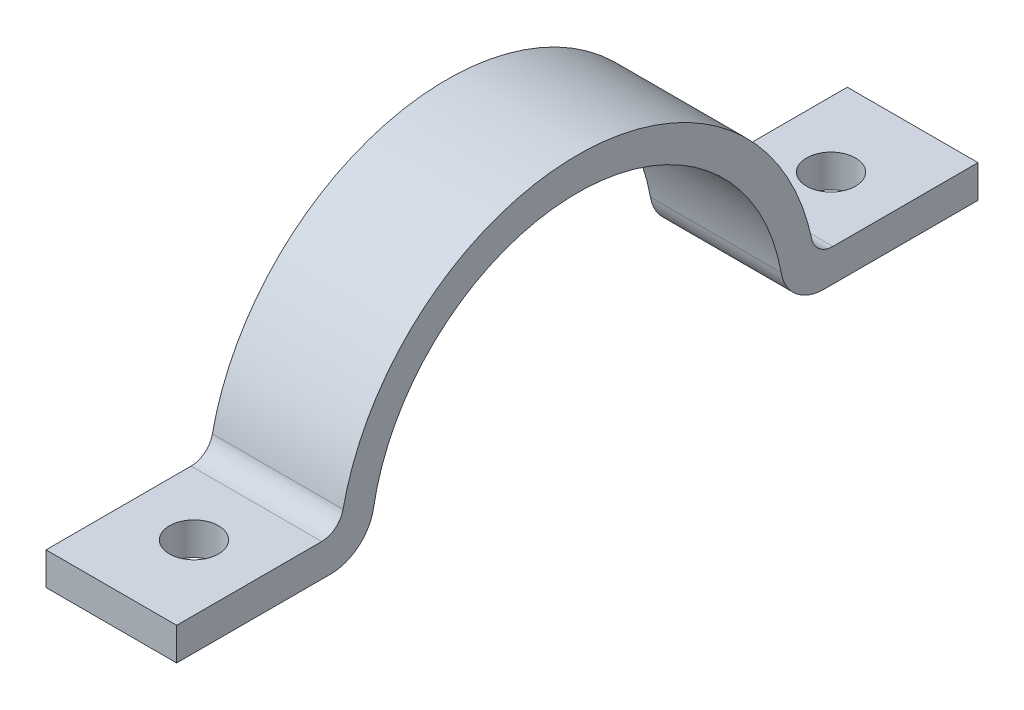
ISO-10303-21;
HEADER;
FILE_DESCRIPTION(('STEP AP214'),'2;1');
FILE_NAME('part.step','',(''),(''),'','','');
FILE_SCHEMA(('AUTOMOTIVE_DESIGN { 1 0 10303 214 1 1 1 1 }'));
ENDSEC;
DATA;
#1=APPLICATION_CONTEXT('core data for automotive mechanical design processes');
#2=APPLICATION_PROTOCOL_DEFINITION('international standard','automotive_design',2000,#1);
#3=PRODUCT_CONTEXT('',#1,'mechanical');
#4=PRODUCT('Part','Part','',(#3));
#5=PRODUCT_RELATED_PRODUCT_CATEGORY('part','',(#4));
#6=PRODUCT_DEFINITION_FORMATION('','',#4);
#7=PRODUCT_DEFINITION_CONTEXT('part definition',#1,'design');
#8=PRODUCT_DEFINITION('design','',#6,#7);
#9=PRODUCT_DEFINITION_SHAPE('','',#8);
#10=(LENGTH_UNIT() NAMED_UNIT(*) SI_UNIT(.MILLI.,.METRE.));
#11=(NAMED_UNIT(*) PLANE_ANGLE_UNIT() SI_UNIT($,.RADIAN.));
#12=(NAMED_UNIT(*) SI_UNIT($,.STERADIAN.) SOLID_ANGLE_UNIT());
#13=UNCERTAINTY_MEASURE_WITH_UNIT(LENGTH_MEASURE(1.E-05),#10,'distance_accuracy_value','');
#14=(GEOMETRIC_REPRESENTATION_CONTEXT(3) GLOBAL_UNCERTAINTY_ASSIGNED_CONTEXT((#13)) GLOBAL_UNIT_ASSIGNED_CONTEXT((#10,
#11,#12)) REPRESENTATION_CONTEXT('',''));
#15=CARTESIAN_POINT('',(0.,0.,0.));
#16=DIRECTION('',(0.,0.,1.));
#17=DIRECTION('',(1.,0.,0.));
#18=AXIS2_PLACEMENT_3D('',#15,#16,#17);
#19=CARTESIAN_POINT('',(12.,0.,0.));
#20=DIRECTION('',(-1.,0.,0.));
#21=DIRECTION('',(0.,0.,1.));
#22=AXIS2_PLACEMENT_3D('',#19,#20,#21);
#23=CYLINDRICAL_SURFACE('',#22,19.);
#24=CARTESIAN_POINT('',(12.,0.,0.));
#25=DIRECTION('',(-1.,0.,0.));
#26=DIRECTION('',(0.,0.,1.));
#27=AXIS2_PLACEMENT_3D('',#24,#25,#26);
#28=CIRCLE('',#27,19.);
#29=CARTESIAN_POINT('',(12.,3.30434782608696,18.7104592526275));
#30=VERTEX_POINT('',#29);
#31=CARTESIAN_POINT('',(12.,3.30434782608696,-18.7104592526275));
#32=VERTEX_POINT('',#31);
#33=EDGE_CURVE('E142',#30,#32,#28,.T.);
#34=ORIENTED_EDGE('',*,*,#33,.F.);
#35=DIRECTION('',(-1.,0.,0.));
#36=VECTOR('',#35,1.);
#37=CARTESIAN_POINT('',(12.,3.30434782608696,18.7104592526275));
#38=LINE('',#37,#36);
#39=CARTESIAN_POINT('',(0.,3.30434782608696,18.7104592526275));
#40=VERTEX_POINT('',#39);
#41=EDGE_CURVE('E216',#30,#40,#38,.T.);
#42=ORIENTED_EDGE('',*,*,#41,.T.);
#43=CARTESIAN_POINT('',(0.,0.,0.));
#44=DIRECTION('',(-1.,0.,0.));
#45=DIRECTION('',(0.,0.,1.));
#46=AXIS2_PLACEMENT_3D('',#43,#44,#45);
#47=CIRCLE('',#46,19.);
#48=CARTESIAN_POINT('',(0.,3.30434782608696,-18.7104592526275));
#49=VERTEX_POINT('',#48);
#50=EDGE_CURVE('E178',#40,#49,#47,.T.);
#51=ORIENTED_EDGE('',*,*,#50,.T.);
#52=DIRECTION('',(-1.,0.,0.));
#53=VECTOR('',#52,1.);
#54=CARTESIAN_POINT('',(12.,3.30434782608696,-18.7104592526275));
#55=LINE('',#54,#53);
#56=EDGE_CURVE('E152',#49,#32,#55,.F.);
#57=ORIENTED_EDGE('',*,*,#56,.T.);
#58=EDGE_LOOP('',(#34,#42,#51,#57));
#59=FACE_BOUND('',#58,.T.);
#60=ADVANCED_FACE('F39',(#59),#23,.F.);
#61=CARTESIAN_POINT('',(12.,0.,-19.));
#62=DIRECTION('',(0.,1.,0.));
#63=DIRECTION('',(0.,0.,1.));
#64=AXIS2_PLACEMENT_3D('',#61,#62,#63);
#65=PLANE('',#64);
#66=CARTESIAN_POINT('',(6.,0.,-29.2944947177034));
#67=DIRECTION('',(0.,1.,0.));
#68=DIRECTION('',(0.,0.,1.));
#69=AXIS2_PLACEMENT_3D('',#66,#67,#68);
#70=CIRCLE('',#69,2.25000000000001);
#71=CARTESIAN_POINT('',(6.,0.,-27.0444947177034));
#72=VERTEX_POINT('',#71);
#73=EDGE_CURVE('E182',#72,#72,#70,.T.);
#74=ORIENTED_EDGE('',*,*,#73,.T.);
#75=EDGE_LOOP('',(#74));
#76=FACE_BOUND('',#75,.T.);
#77=DIRECTION('',(0.,0.,-1.));
#78=VECTOR('',#77,1.);
#79=CARTESIAN_POINT('',(12.,0.,-19.));
#80=LINE('',#79,#78);
#81=CARTESIAN_POINT('',(12.,0.,-22.6495033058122));
#82=VERTEX_POINT('',#81);
#83=CARTESIAN_POINT('',(12.,0.,-36.7944947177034));
#84=VERTEX_POINT('',#83);
#85=EDGE_CURVE('E128',#82,#84,#80,.T.);
#86=ORIENTED_EDGE('',*,*,#85,.F.);
#87=DIRECTION('',(-1.,0.,0.));
#88=VECTOR('',#87,1.);
#89=CARTESIAN_POINT('',(12.,0.,-22.6495033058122));
#90=LINE('',#89,#88);
#91=CARTESIAN_POINT('',(0.,0.,-22.6495033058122));
#92=VERTEX_POINT('',#91);
#93=EDGE_CURVE('E234',#82,#92,#90,.T.);
#94=ORIENTED_EDGE('',*,*,#93,.T.);
#95=DIRECTION('',(0.,0.,-1.));
#96=VECTOR('',#95,1.);
#97=CARTESIAN_POINT('',(0.,0.,-19.));
#98=LINE('',#97,#96);
#99=CARTESIAN_POINT('',(0.,0.,-36.7944947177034));
#100=VERTEX_POINT('',#99);
#101=EDGE_CURVE('E148',#92,#100,#98,.T.);
#102=ORIENTED_EDGE('',*,*,#101,.T.);
#103=DIRECTION('',(-1.,0.,0.));
#104=VECTOR('',#103,1.);
#105=CARTESIAN_POINT('',(12.,0.,-36.7944947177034));
#106=LINE('',#105,#104);
#107=EDGE_CURVE('E145',#84,#100,#106,.T.);
#108=ORIENTED_EDGE('',*,*,#107,.F.);
#109=EDGE_LOOP('',(#86,#94,#102,#108));
#110=FACE_BOUND('',#109,.T.);
#111=ADVANCED_FACE('F146',(#76,#110),#65,.F.);
#112=CARTESIAN_POINT('',(12.,0.,-36.7944947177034));
#113=DIRECTION('',(0.,0.,1.));
#114=DIRECTION('',(1.,0.,0.));
#115=AXIS2_PLACEMENT_3D('',#112,#113,#114);
#116=PLANE('',#115);
#117=DIRECTION('',(0.,1.,0.));
#118=VECTOR('',#117,1.);
#119=CARTESIAN_POINT('',(0.,0.,-36.7944947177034));
#120=LINE('',#119,#118);
#121=CARTESIAN_POINT('',(0.,3.,-36.7944947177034));
#122=VERTEX_POINT('',#121);
#123=EDGE_CURVE('E185',#100,#122,#120,.T.);
#124=ORIENTED_EDGE('',*,*,#123,.T.);
#125=DIRECTION('',(-1.,0.,0.));
#126=VECTOR('',#125,1.);
#127=CARTESIAN_POINT('',(12.,3.,-36.7944947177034));
#128=LINE('',#127,#126);
#129=CARTESIAN_POINT('',(12.,3.,-36.7944947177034));
#130=VERTEX_POINT('',#129);
#131=EDGE_CURVE('E153',#130,#122,#128,.T.);
#132=ORIENTED_EDGE('',*,*,#131,.F.);
#133=DIRECTION('',(0.,1.,0.));
#134=VECTOR('',#133,1.);
#135=CARTESIAN_POINT('',(12.,0.,-36.7944947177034));
#136=LINE('',#135,#134);
#137=EDGE_CURVE('E133',#84,#130,#136,.T.);
#138=ORIENTED_EDGE('',*,*,#137,.F.);
#139=ORIENTED_EDGE('',*,*,#107,.T.);
#140=EDGE_LOOP('',(#124,#132,#138,#139));
#141=FACE_BOUND('',#140,.T.);
#142=ADVANCED_FACE('F155',(#141),#116,.F.);
#143=CARTESIAN_POINT('',(12.,3.,-36.7944947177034));
#144=DIRECTION('',(0.,-1.,0.));
#145=DIRECTION('',(0.,0.,-1.));
#146=AXIS2_PLACEMENT_3D('',#143,#144,#145);
#147=PLANE('',#146);
#148=CARTESIAN_POINT('',(6.,3.,-29.2944947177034));
#149=DIRECTION('',(0.,1.,0.));
#150=DIRECTION('',(0.,0.,1.));
#151=AXIS2_PLACEMENT_3D('',#148,#149,#150);
#152=CIRCLE('',#151,2.25000000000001);
#153=CARTESIAN_POINT('',(6.,3.,-27.0444947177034));
#154=VERTEX_POINT('',#153);
#155=EDGE_CURVE('E341',#154,#154,#152,.T.);
#156=ORIENTED_EDGE('',*,*,#155,.F.);
#157=EDGE_LOOP('',(#156));
#158=FACE_BOUND('',#157,.T.);
#159=DIRECTION('',(0.,0.,1.));
#160=VECTOR('',#159,1.);
#161=CARTESIAN_POINT('',(0.,3.,-36.7944947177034));
#162=LINE('',#161,#160);
#163=CARTESIAN_POINT('',(0.,3.,-23.473389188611));
#164=VERTEX_POINT('',#163);
#165=EDGE_CURVE('E188',#122,#164,#162,.T.);
#166=ORIENTED_EDGE('',*,*,#165,.T.);
#167=DIRECTION('',(1.,0.,0.));
#168=VECTOR('',#167,1.);
#169=CARTESIAN_POINT('',(12.,3.,-23.473389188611));
#170=LINE('',#169,#168);
#171=CARTESIAN_POINT('',(12.,3.,-23.473389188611));
#172=VERTEX_POINT('',#171);
#173=EDGE_CURVE('E55',#164,#172,#170,.T.);
#174=ORIENTED_EDGE('',*,*,#173,.T.);
#175=DIRECTION('',(0.,0.,1.));
#176=VECTOR('',#175,1.);
#177=CARTESIAN_POINT('',(12.,3.,-36.7944947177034));
#178=LINE('',#177,#176);
#179=EDGE_CURVE('E158',#130,#172,#178,.T.);
#180=ORIENTED_EDGE('',*,*,#179,.F.);
#181=ORIENTED_EDGE('',*,*,#131,.T.);
#182=EDGE_LOOP('',(#166,#174,#180,#181));
#183=FACE_BOUND('',#182,.T.);
#184=ADVANCED_FACE('F276',(#158,#183),#147,.F.);
#185=CARTESIAN_POINT('',(12.,0.,0.));
#186=DIRECTION('',(-1.,0.,0.));
#187=DIRECTION('',(0.,0.,1.));
#188=AXIS2_PLACEMENT_3D('',#185,#186,#187);
#189=CYLINDRICAL_SURFACE('',#188,22.);
#190=CARTESIAN_POINT('',(0.,0.,0.));
#191=DIRECTION('',(1.,0.,0.));
#192=DIRECTION('',(0.,0.,1.));
#193=AXIS2_PLACEMENT_3D('',#190,#191,#192);
#194=CIRCLE('',#193,22.);
#195=CARTESIAN_POINT('',(0.,4.58333333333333,-21.5172734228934));
#196=VERTEX_POINT('',#195);
#197=CARTESIAN_POINT('',(0.,4.58333333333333,21.5172734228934));
#198=VERTEX_POINT('',#197);
#199=EDGE_CURVE('E191',#196,#198,#194,.T.);
#200=ORIENTED_EDGE('',*,*,#199,.T.);
#201=DIRECTION('',(-1.,0.,0.));
#202=VECTOR('',#201,1.);
#203=CARTESIAN_POINT('',(12.,4.58333333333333,21.5172734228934));
#204=LINE('',#203,#202);
#205=CARTESIAN_POINT('',(12.,4.58333333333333,21.5172734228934));
#206=VERTEX_POINT('',#205);
#207=EDGE_CURVE('E245',#198,#206,#204,.F.);
#208=ORIENTED_EDGE('',*,*,#207,.T.);
#209=CARTESIAN_POINT('',(12.,0.,0.));
#210=DIRECTION('',(1.,0.,0.));
#211=DIRECTION('',(0.,0.,1.));
#212=AXIS2_PLACEMENT_3D('',#209,#210,#211);
#213=CIRCLE('',#212,22.);
#214=CARTESIAN_POINT('',(12.,4.58333333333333,-21.5172734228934));
#215=VERTEX_POINT('',#214);
#216=EDGE_CURVE('E161',#215,#206,#213,.T.);
#217=ORIENTED_EDGE('',*,*,#216,.F.);
#218=DIRECTION('',(-1.,0.,0.));
#219=VECTOR('',#218,1.);
#220=CARTESIAN_POINT('',(12.,4.58333333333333,-21.5172734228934));
#221=LINE('',#220,#219);
#222=EDGE_CURVE('E241',#215,#196,#221,.T.);
#223=ORIENTED_EDGE('',*,*,#222,.T.);
#224=EDGE_LOOP('',(#200,#208,#217,#223));
#225=FACE_BOUND('',#224,.T.);
#226=ADVANCED_FACE('F272',(#225),#189,.T.);
#227=CARTESIAN_POINT('',(12.,3.,36.7944947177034));
#228=DIRECTION('',(0.,-1.,0.));
#229=DIRECTION('',(0.,0.,-1.));
#230=AXIS2_PLACEMENT_3D('',#227,#228,#229);
#231=PLANE('',#230);
#232=CARTESIAN_POINT('',(6.,3.,29.2055052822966));
#233=DIRECTION('',(0.,1.,0.));
#234=DIRECTION('',(0.,0.,1.));
#235=AXIS2_PLACEMENT_3D('',#232,#233,#234);
#236=CIRCLE('',#235,2.25000000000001);
#237=CARTESIAN_POINT('',(6.,3.,31.4555052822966));
#238=VERTEX_POINT('',#237);
#239=EDGE_CURVE('E337',#238,#238,#236,.T.);
#240=ORIENTED_EDGE('',*,*,#239,.F.);
#241=EDGE_LOOP('',(#240));
#242=FACE_BOUND('',#241,.T.);
#243=DIRECTION('',(0.,0.,1.));
#244=VECTOR('',#243,1.);
#245=CARTESIAN_POINT('',(12.,3.,36.7944947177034));
#246=LINE('',#245,#244);
#247=CARTESIAN_POINT('',(12.,3.,23.473389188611));
#248=VERTEX_POINT('',#247);
#249=CARTESIAN_POINT('',(12.,3.,36.7944947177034));
#250=VERTEX_POINT('',#249);
#251=EDGE_CURVE('E168',#248,#250,#246,.T.);
#252=ORIENTED_EDGE('',*,*,#251,.F.);
#253=DIRECTION('',(1.,0.,0.));
#254=VECTOR('',#253,1.);
#255=CARTESIAN_POINT('',(0.,3.,23.473389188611));
#256=LINE('',#255,#254);
#257=CARTESIAN_POINT('',(0.,3.,23.473389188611));
#258=VERTEX_POINT('',#257);
#259=EDGE_CURVE('E237',#248,#258,#256,.F.);
#260=ORIENTED_EDGE('',*,*,#259,.T.);
#261=DIRECTION('',(0.,0.,1.));
#262=VECTOR('',#261,1.);
#263=CARTESIAN_POINT('',(0.,3.,36.7944947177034));
#264=LINE('',#263,#262);
#265=CARTESIAN_POINT('',(0.,3.,36.7944947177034));
#266=VERTEX_POINT('',#265);
#267=EDGE_CURVE('E195',#258,#266,#264,.T.);
#268=ORIENTED_EDGE('',*,*,#267,.T.);
#269=DIRECTION('',(-1.,0.,0.));
#270=VECTOR('',#269,1.);
#271=CARTESIAN_POINT('',(12.,3.,36.7944947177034));
#272=LINE('',#271,#270);
#273=EDGE_CURVE('E208',#250,#266,#272,.T.);
#274=ORIENTED_EDGE('',*,*,#273,.F.);
#275=EDGE_LOOP('',(#252,#260,#268,#274));
#276=FACE_BOUND('',#275,.T.);
#277=ADVANCED_FACE('F264',(#242,#276),#231,.F.);
#278=CARTESIAN_POINT('',(12.,0.,36.7944947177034));
#279=DIRECTION('',(0.,0.,-1.));
#280=DIRECTION('',(-1.,0.,0.));
#281=AXIS2_PLACEMENT_3D('',#278,#279,#280);
#282=PLANE('',#281);
#283=DIRECTION('',(0.,-1.,0.));
#284=VECTOR('',#283,1.);
#285=CARTESIAN_POINT('',(0.,0.,36.7944947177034));
#286=LINE('',#285,#284);
#287=CARTESIAN_POINT('',(0.,0.,36.7944947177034));
#288=VERTEX_POINT('',#287);
#289=EDGE_CURVE('E198',#266,#288,#286,.T.);
#290=ORIENTED_EDGE('',*,*,#289,.T.);
#291=DIRECTION('',(-1.,0.,0.));
#292=VECTOR('',#291,1.);
#293=CARTESIAN_POINT('',(12.,0.,36.7944947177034));
#294=LINE('',#293,#292);
#295=CARTESIAN_POINT('',(12.,0.,36.7944947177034));
#296=VERTEX_POINT('',#295);
#297=EDGE_CURVE('E177',#296,#288,#294,.T.);
#298=ORIENTED_EDGE('',*,*,#297,.F.);
#299=DIRECTION('',(0.,-1.,0.));
#300=VECTOR('',#299,1.);
#301=CARTESIAN_POINT('',(12.,0.,36.7944947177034));
#302=LINE('',#301,#300);
#303=EDGE_CURVE('E171',#250,#296,#302,.T.);
#304=ORIENTED_EDGE('',*,*,#303,.F.);
#305=ORIENTED_EDGE('',*,*,#273,.T.);
#306=EDGE_LOOP('',(#290,#298,#304,#305));
#307=FACE_BOUND('',#306,.T.);
#308=ADVANCED_FACE('F310',(#307),#282,.F.);
#309=CARTESIAN_POINT('',(12.,0.,19.));
#310=DIRECTION('',(0.,1.,0.));
#311=DIRECTION('',(0.,0.,1.));
#312=AXIS2_PLACEMENT_3D('',#309,#310,#311);
#313=PLANE('',#312);
#314=CARTESIAN_POINT('',(6.,0.,29.2055052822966));
#315=DIRECTION('',(0.,1.,0.));
#316=DIRECTION('',(0.,0.,1.));
#317=AXIS2_PLACEMENT_3D('',#314,#315,#316);
#318=CIRCLE('',#317,2.25000000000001);
#319=CARTESIAN_POINT('',(6.,0.,31.4555052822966));
#320=VERTEX_POINT('',#319);
#321=EDGE_CURVE('E334',#320,#320,#318,.T.);
#322=ORIENTED_EDGE('',*,*,#321,.T.);
#323=EDGE_LOOP('',(#322));
#324=FACE_BOUND('',#323,.T.);
#325=DIRECTION('',(0.,0.,-1.));
#326=VECTOR('',#325,1.);
#327=CARTESIAN_POINT('',(0.,0.,19.));
#328=LINE('',#327,#326);
#329=CARTESIAN_POINT('',(0.,0.,22.6495033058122));
#330=VERTEX_POINT('',#329);
#331=EDGE_CURVE('E201',#288,#330,#328,.T.);
#332=ORIENTED_EDGE('',*,*,#331,.T.);
#333=DIRECTION('',(-1.,0.,0.));
#334=VECTOR('',#333,1.);
#335=CARTESIAN_POINT('',(12.,0.,22.6495033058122));
#336=LINE('',#335,#334);
#337=CARTESIAN_POINT('',(12.,0.,22.6495033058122));
#338=VERTEX_POINT('',#337);
#339=EDGE_CURVE('E226',#330,#338,#336,.F.);
#340=ORIENTED_EDGE('',*,*,#339,.T.);
#341=DIRECTION('',(0.,0.,-1.));
#342=VECTOR('',#341,1.);
#343=CARTESIAN_POINT('',(12.,0.,19.));
#344=LINE('',#343,#342);
#345=EDGE_CURVE('E174',#296,#338,#344,.T.);
#346=ORIENTED_EDGE('',*,*,#345,.F.);
#347=ORIENTED_EDGE('',*,*,#297,.T.);
#348=EDGE_LOOP('',(#332,#340,#346,#347));
#349=FACE_BOUND('',#348,.T.);
#350=ADVANCED_FACE('F314',(#324,#349),#313,.F.);
#351=CARTESIAN_POINT('',(12.,0.,0.));
#352=DIRECTION('',(-1.,0.,0.));
#353=DIRECTION('',(0.,0.,1.));
#354=AXIS2_PLACEMENT_3D('',#351,#352,#353);
#355=PLANE('',#354);
#356=ORIENTED_EDGE('',*,*,#345,.T.);
#357=CARTESIAN_POINT('',(12.,4.,22.6495033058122));
#358=DIRECTION('',(-1.,0.,0.));
#359=DIRECTION('',(0.,0.,1.));
#360=AXIS2_PLACEMENT_3D('',#357,#358,#359);
#361=CIRCLE('',#360,4.);
#362=EDGE_CURVE('E231',#338,#30,#361,.F.);
#363=ORIENTED_EDGE('',*,*,#362,.T.);
#364=ORIENTED_EDGE('',*,*,#33,.T.);
#365=CARTESIAN_POINT('',(12.,4.,-22.6495033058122));
#366=DIRECTION('',(-1.,0.,0.));
#367=DIRECTION('',(0.,0.,1.));
#368=AXIS2_PLACEMENT_3D('',#365,#366,#367);
#369=CIRCLE('',#368,4.);
#370=EDGE_CURVE('E137',#32,#82,#369,.F.);
#371=ORIENTED_EDGE('',*,*,#370,.T.);
#372=ORIENTED_EDGE('',*,*,#85,.T.);
#373=ORIENTED_EDGE('',*,*,#137,.T.);
#374=ORIENTED_EDGE('',*,*,#179,.T.);
#375=CARTESIAN_POINT('',(12.,5.,-23.473389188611));
#376=DIRECTION('',(-1.,0.,0.));
#377=DIRECTION('',(0.,0.,1.));
#378=AXIS2_PLACEMENT_3D('',#375,#376,#377);
#379=CIRCLE('',#378,2.);
#380=EDGE_CURVE('E11',#172,#215,#379,.T.);
#381=ORIENTED_EDGE('',*,*,#380,.T.);
#382=ORIENTED_EDGE('',*,*,#216,.T.);
#383=CARTESIAN_POINT('',(12.,5.,23.473389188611));
#384=DIRECTION('',(-1.,0.,0.));
#385=DIRECTION('',(0.,0.,1.));
#386=AXIS2_PLACEMENT_3D('',#383,#384,#385);
#387=CIRCLE('',#386,2.);
#388=EDGE_CURVE('E253',#206,#248,#387,.T.);
#389=ORIENTED_EDGE('',*,*,#388,.T.);
#390=ORIENTED_EDGE('',*,*,#251,.T.);
#391=ORIENTED_EDGE('',*,*,#303,.T.);
#392=EDGE_LOOP('',(#356,#363,#364,#371,#372,#373,#374,#381,#382,#389,#390,#391));
#393=FACE_BOUND('',#392,.T.);
#394=ADVANCED_FACE('F131',(#393),#355,.F.);
#395=CARTESIAN_POINT('',(0.,0.,0.));
#396=DIRECTION('',(-1.,0.,0.));
#397=DIRECTION('',(0.,0.,1.));
#398=AXIS2_PLACEMENT_3D('',#395,#396,#397);
#399=PLANE('',#398);
#400=ORIENTED_EDGE('',*,*,#50,.F.);
#401=CARTESIAN_POINT('',(0.,4.,22.6495033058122));
#402=DIRECTION('',(-1.,0.,0.));
#403=DIRECTION('',(0.,0.,1.));
#404=AXIS2_PLACEMENT_3D('',#401,#402,#403);
#405=CIRCLE('',#404,4.);
#406=EDGE_CURVE('E223',#40,#330,#405,.T.);
#407=ORIENTED_EDGE('',*,*,#406,.T.);
#408=ORIENTED_EDGE('',*,*,#331,.F.);
#409=ORIENTED_EDGE('',*,*,#289,.F.);
#410=ORIENTED_EDGE('',*,*,#267,.F.);
#411=CARTESIAN_POINT('',(0.,5.,23.473389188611));
#412=DIRECTION('',(-1.,0.,0.));
#413=DIRECTION('',(0.,0.,1.));
#414=AXIS2_PLACEMENT_3D('',#411,#412,#413);
#415=CIRCLE('',#414,2.);
#416=EDGE_CURVE('E250',#258,#198,#415,.F.);
#417=ORIENTED_EDGE('',*,*,#416,.T.);
#418=ORIENTED_EDGE('',*,*,#199,.F.);
#419=CARTESIAN_POINT('',(0.,5.,-23.473389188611));
#420=DIRECTION('',(-1.,0.,0.));
#421=DIRECTION('',(0.,0.,1.));
#422=AXIS2_PLACEMENT_3D('',#419,#420,#421);
#423=CIRCLE('',#422,2.);
#424=EDGE_CURVE('E48',#196,#164,#423,.F.);
#425=ORIENTED_EDGE('',*,*,#424,.T.);
#426=ORIENTED_EDGE('',*,*,#165,.F.);
#427=ORIENTED_EDGE('',*,*,#123,.F.);
#428=ORIENTED_EDGE('',*,*,#101,.F.);
#429=CARTESIAN_POINT('',(0.,4.,-22.6495033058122));
#430=DIRECTION('',(-1.,0.,0.));
#431=DIRECTION('',(0.,0.,1.));
#432=AXIS2_PLACEMENT_3D('',#429,#430,#431);
#433=CIRCLE('',#432,4.);
#434=EDGE_CURVE('E220',#92,#49,#433,.T.);
#435=ORIENTED_EDGE('',*,*,#434,.T.);
#436=EDGE_LOOP('',(#400,#407,#408,#409,#410,#417,#418,#425,#426,#427,#428,#435));
#437=FACE_BOUND('',#436,.T.);
#438=ADVANCED_FACE('F269',(#437),#399,.T.);
#439=CARTESIAN_POINT('',(6.,0.,-29.2944947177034));
#440=DIRECTION('',(0.,1.,0.));
#441=DIRECTION('',(0.,0.,1.));
#442=AXIS2_PLACEMENT_3D('',#439,#440,#441);
#443=CYLINDRICAL_SURFACE('',#442,2.25000000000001);
#444=ORIENTED_EDGE('',*,*,#73,.F.);
#445=EDGE_LOOP('',(#444));
#446=FACE_BOUND('',#445,.T.);
#447=ORIENTED_EDGE('',*,*,#155,.T.);
#448=EDGE_LOOP('',(#447));
#449=FACE_BOUND('',#448,.T.);
#450=ADVANCED_FACE('F321',(#446,#449),#443,.F.);
#451=CARTESIAN_POINT('',(6.,0.,29.2055052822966));
#452=DIRECTION('',(0.,1.,0.));
#453=DIRECTION('',(0.,0.,1.));
#454=AXIS2_PLACEMENT_3D('',#451,#452,#453);
#455=CYLINDRICAL_SURFACE('',#454,2.25000000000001);
#456=CARTESIAN_POINT('',(6.,0.,31.4555052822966));
#457=CARTESIAN_POINT('',(6.,0.0312499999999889,31.4555052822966));
#458=CARTESIAN_POINT('',(6.,0.062499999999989,31.4555052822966));
#459=CARTESIAN_POINT('',(6.,0.124999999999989,31.4555052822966));
#460=CARTESIAN_POINT('',(6.,0.156249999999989,31.4555052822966));
#461=CARTESIAN_POINT('',(6.,0.218749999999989,31.4555052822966));
#462=CARTESIAN_POINT('',(6.,0.249999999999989,31.4555052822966));
#463=CARTESIAN_POINT('',(6.,0.31249999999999,31.4555052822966));
#464=CARTESIAN_POINT('',(6.,0.34374999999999,31.4555052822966));
#465=CARTESIAN_POINT('',(6.,0.40624999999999,31.4555052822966));
#466=CARTESIAN_POINT('',(6.,0.43749999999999,31.4555052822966));
#467=CARTESIAN_POINT('',(6.,0.49999999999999,31.4555052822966));
#468=CARTESIAN_POINT('',(6.,0.53124999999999,31.4555052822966));
#469=CARTESIAN_POINT('',(6.,0.59374999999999,31.4555052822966));
#470=CARTESIAN_POINT('',(6.,0.62499999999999,31.4555052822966));
#471=CARTESIAN_POINT('',(6.,0.68749999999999,31.4555052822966));
#472=CARTESIAN_POINT('',(6.,0.718749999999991,31.4555052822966));
#473=CARTESIAN_POINT('',(6.,0.781249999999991,31.4555052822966));
#474=CARTESIAN_POINT('',(6.,0.812499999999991,31.4555052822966));
#475=CARTESIAN_POINT('',(6.,0.874999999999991,31.4555052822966));
#476=CARTESIAN_POINT('',(6.,0.906249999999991,31.4555052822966));
#477=CARTESIAN_POINT('',(6.,0.968749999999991,31.4555052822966));
#478=CARTESIAN_POINT('',(6.,0.999999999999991,31.4555052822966));
#479=CARTESIAN_POINT('',(6.,1.06249999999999,31.4555052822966));
#480=CARTESIAN_POINT('',(6.,1.09374999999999,31.4555052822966));
#481=CARTESIAN_POINT('',(6.,1.15624999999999,31.4555052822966));
#482=CARTESIAN_POINT('',(6.,1.18749999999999,31.4555052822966));
#483=CARTESIAN_POINT('',(6.,1.24999999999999,31.4555052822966));
#484=CARTESIAN_POINT('',(6.,1.28124999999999,31.4555052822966));
#485=CARTESIAN_POINT('',(6.,1.34374999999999,31.4555052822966));
#486=CARTESIAN_POINT('',(6.,1.37499999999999,31.4555052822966));
#487=CARTESIAN_POINT('',(6.,1.43749999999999,31.4555052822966));
#488=CARTESIAN_POINT('',(6.,1.46874999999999,31.4555052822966));
#489=CARTESIAN_POINT('',(6.,1.53124999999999,31.4555052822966));
#490=CARTESIAN_POINT('',(6.,1.56249999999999,31.4555052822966));
#491=CARTESIAN_POINT('',(6.,1.62499999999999,31.4555052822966));
#492=CARTESIAN_POINT('',(6.,1.65624999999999,31.4555052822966));
#493=CARTESIAN_POINT('',(6.,1.71874999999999,31.4555052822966));
#494=CARTESIAN_POINT('',(6.,1.74999999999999,31.4555052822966));
#495=CARTESIAN_POINT('',(6.,1.81249999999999,31.4555052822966));
#496=CARTESIAN_POINT('',(6.,1.84374999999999,31.4555052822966));
#497=CARTESIAN_POINT('',(6.,1.90624999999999,31.4555052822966));
#498=CARTESIAN_POINT('',(6.,1.93749999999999,31.4555052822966));
#499=CARTESIAN_POINT('',(6.,1.99999999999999,31.4555052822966));
#500=CARTESIAN_POINT('',(6.,2.03124999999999,31.4555052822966));
#501=CARTESIAN_POINT('',(6.,2.09374999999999,31.4555052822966));
#502=CARTESIAN_POINT('',(6.,2.12499999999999,31.4555052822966));
#503=CARTESIAN_POINT('',(6.,2.18749999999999,31.4555052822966));
#504=CARTESIAN_POINT('',(6.,2.21874999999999,31.4555052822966));
#505=CARTESIAN_POINT('',(6.,2.28124999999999,31.4555052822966));
#506=CARTESIAN_POINT('',(6.,2.31249999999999,31.4555052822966));
#507=CARTESIAN_POINT('',(6.,2.37499999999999,31.4555052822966));
#508=CARTESIAN_POINT('',(6.,2.40624999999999,31.4555052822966));
#509=CARTESIAN_POINT('',(6.,2.46874999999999,31.4555052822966));
#510=CARTESIAN_POINT('',(6.,2.49999999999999,31.4555052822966));
#511=CARTESIAN_POINT('',(6.,2.56249999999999,31.4555052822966));
#512=CARTESIAN_POINT('',(6.,2.59374999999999,31.4555052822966));
#513=CARTESIAN_POINT('',(6.,2.65624999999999,31.4555052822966));
#514=CARTESIAN_POINT('',(6.,2.68749999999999,31.4555052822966));
#515=CARTESIAN_POINT('',(6.,2.74999999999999,31.4555052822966));
#516=CARTESIAN_POINT('',(6.,2.78124999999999,31.4555052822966));
#517=CARTESIAN_POINT('',(6.,2.84374999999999,31.4555052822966));
#518=CARTESIAN_POINT('',(6.,2.875,31.4555052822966));
#519=CARTESIAN_POINT('',(6.,2.9375,31.4555052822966));
#520=CARTESIAN_POINT('',(6.,2.96875,31.4555052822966));
#521=CARTESIAN_POINT('',(6.,3.,31.4555052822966));
#522=B_SPLINE_CURVE_WITH_KNOTS('',3,(#456,#457,#458,#459,#460,#461,#462,#463,#464,#465,#466,
#467,#468,#469,#470,#471,#472,#473,#474,#475,#476,#477,#478,#479,#480,#481,#482,#483,#484,#485,
#486,#487,#488,#489,#490,#491,#492,#493,#494,#495,#496,#497,#498,#499,#500,#501,#502,#503,#504,
#505,#506,#507,#508,#509,#510,#511,#512,#513,#514,#515,#516,#517,#518,#519,#520,#521),
.UNSPECIFIED.,.F.,.F.,(4,2,2,2,2,2,2,2,2,2,2,2,2,2,2,2,2,2,2,2,2,2,2,2,2,2,2,2,2,2,2,2,4),(0.,
0.0937500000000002,0.1875,0.281250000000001,0.375000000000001,0.468750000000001,
0.562500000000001,0.656250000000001,0.750000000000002,0.843750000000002,0.937500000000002,
1.03125,1.125,1.21875,1.3125,1.40625,1.5,1.59375,1.6875,1.78125,1.875,1.96875,2.0625,2.15625,
2.25,2.34375000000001,2.43750000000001,2.53125000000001,2.62500000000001,2.71875000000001,
2.81250000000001,2.90625000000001,3.00000000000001),.UNSPECIFIED.);
#523=EDGE_CURVE('BSEAM290',#320,#238,#522,.T.);
#524=ORIENTED_EDGE('',*,*,#321,.F.);
#525=ORIENTED_EDGE('',*,*,#239,.T.);
#526=ORIENTED_EDGE('',*,*,#523,.T.);
#527=ORIENTED_EDGE('',*,*,#523,.F.);
#528=EDGE_LOOP('',(#524,#526,#525,#527));
#529=FACE_BOUND('',#528,.T.);
#530=ADVANCED_FACE('F290',(#529),#455,.F.);
#531=CARTESIAN_POINT('',(12.,4.,22.6495033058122));
#532=DIRECTION('',(-1.,0.,0.));
#533=DIRECTION('',(0.,0.,1.));
#534=AXIS2_PLACEMENT_3D('',#531,#532,#533);
#535=CYLINDRICAL_SURFACE('',#534,4.);
#536=ORIENTED_EDGE('',*,*,#362,.F.);
#537=ORIENTED_EDGE('',*,*,#339,.F.);
#538=ORIENTED_EDGE('',*,*,#406,.F.);
#539=ORIENTED_EDGE('',*,*,#41,.F.);
#540=EDGE_LOOP('',(#536,#537,#538,#539));
#541=FACE_BOUND('',#540,.T.);
#542=ADVANCED_FACE('F284',(#541),#535,.T.);
#543=CARTESIAN_POINT('',(12.,4.,-22.6495033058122));
#544=DIRECTION('',(-1.,0.,0.));
#545=DIRECTION('',(0.,0.,1.));
#546=AXIS2_PLACEMENT_3D('',#543,#544,#545);
#547=CYLINDRICAL_SURFACE('',#546,4.);
#548=ORIENTED_EDGE('',*,*,#370,.F.);
#549=ORIENTED_EDGE('',*,*,#56,.F.);
#550=ORIENTED_EDGE('',*,*,#434,.F.);
#551=ORIENTED_EDGE('',*,*,#93,.F.);
#552=EDGE_LOOP('',(#548,#549,#550,#551));
#553=FACE_BOUND('',#552,.T.);
#554=ADVANCED_FACE('F282',(#553),#547,.T.);
#555=CARTESIAN_POINT('',(12.,5.,23.473389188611));
#556=DIRECTION('',(-1.,0.,0.));
#557=DIRECTION('',(0.,0.,1.));
#558=AXIS2_PLACEMENT_3D('',#555,#556,#557);
#559=CYLINDRICAL_SURFACE('',#558,2.);
#560=ORIENTED_EDGE('',*,*,#388,.F.);
#561=ORIENTED_EDGE('',*,*,#207,.F.);
#562=ORIENTED_EDGE('',*,*,#416,.F.);
#563=ORIENTED_EDGE('',*,*,#259,.F.);
#564=EDGE_LOOP('',(#560,#561,#562,#563));
#565=FACE_BOUND('',#564,.T.);
#566=ADVANCED_FACE('F267',(#565),#559,.F.);
#567=CARTESIAN_POINT('',(12.,5.,-23.473389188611));
#568=DIRECTION('',(-1.,0.,0.));
#569=DIRECTION('',(0.,0.,1.));
#570=AXIS2_PLACEMENT_3D('',#567,#568,#569);
#571=CYLINDRICAL_SURFACE('',#570,2.);
#572=ORIENTED_EDGE('',*,*,#380,.F.);
#573=ORIENTED_EDGE('',*,*,#173,.F.);
#574=ORIENTED_EDGE('',*,*,#424,.F.);
#575=ORIENTED_EDGE('',*,*,#222,.F.);
#576=EDGE_LOOP('',(#572,#573,#574,#575));
#577=FACE_BOUND('',#576,.T.);
#578=ADVANCED_FACE('F41',(#577),#571,.F.);
#579=CLOSED_SHELL('',(#60,#111,#142,#184,#226,#277,#308,#350,#394,#438,#450,#530,#542,#554,#566,#578));
#580=MANIFOLD_SOLID_BREP('B2',#579);
#581=ADVANCED_BREP_SHAPE_REPRESENTATION('',(#18,#580),#14);
#582=SHAPE_DEFINITION_REPRESENTATION(#9,#581);
ENDSEC;
END-ISO-10303-21;
